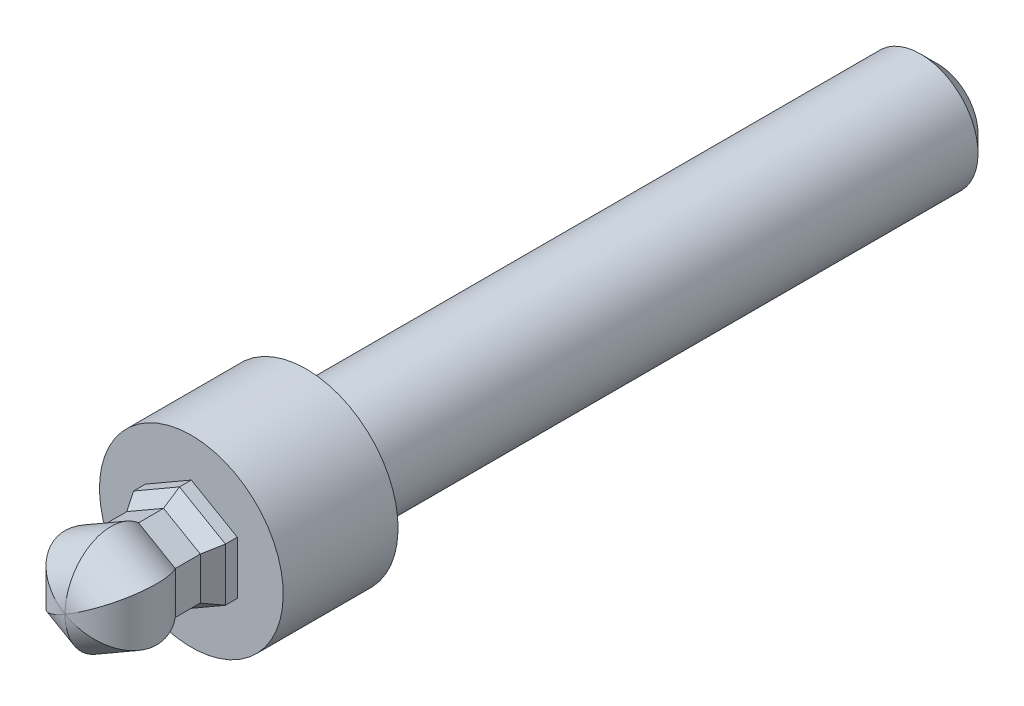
ISO-10303-21;
HEADER;
FILE_DESCRIPTION(('STEP AP214'),'2;1');
FILE_NAME('part.step','',(''),(''),'','','');
FILE_SCHEMA(('AUTOMOTIVE_DESIGN { 1 0 10303 214 1 1 1 1 }'));
ENDSEC;
DATA;
#1=APPLICATION_CONTEXT('core data for automotive mechanical design processes');
#2=APPLICATION_PROTOCOL_DEFINITION('international standard','automotive_design',2000,#1);
#3=PRODUCT_CONTEXT('',#1,'mechanical');
#4=PRODUCT('Part','Part','',(#3));
#5=PRODUCT_RELATED_PRODUCT_CATEGORY('part','',(#4));
#6=PRODUCT_DEFINITION_FORMATION('','',#4);
#7=PRODUCT_DEFINITION_CONTEXT('part definition',#1,'design');
#8=PRODUCT_DEFINITION('design','',#6,#7);
#9=PRODUCT_DEFINITION_SHAPE('','',#8);
#10=(LENGTH_UNIT() NAMED_UNIT(*) SI_UNIT(.MILLI.,.METRE.));
#11=(NAMED_UNIT(*) PLANE_ANGLE_UNIT() SI_UNIT($,.RADIAN.));
#12=(NAMED_UNIT(*) SI_UNIT($,.STERADIAN.) SOLID_ANGLE_UNIT());
#13=UNCERTAINTY_MEASURE_WITH_UNIT(LENGTH_MEASURE(1.E-05),#10,'distance_accuracy_value','');
#14=(GEOMETRIC_REPRESENTATION_CONTEXT(3) GLOBAL_UNCERTAINTY_ASSIGNED_CONTEXT((#13)) GLOBAL_UNIT_ASSIGNED_CONTEXT((#10,
#11,#12)) REPRESENTATION_CONTEXT('',''));
#15=CARTESIAN_POINT('',(0.,0.,0.));
#16=DIRECTION('',(0.,0.,1.));
#17=DIRECTION('',(1.,0.,0.));
#18=AXIS2_PLACEMENT_3D('',#15,#16,#17);
#19=CARTESIAN_POINT('',(0.,0.,-11.));
#20=DIRECTION('',(0.,0.,-1.));
#21=DIRECTION('',(-0.866025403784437,0.5,0.));
#22=AXIS2_PLACEMENT_3D('',#19,#20,#21);
#23=PLANE('',#22);
#24=CARTESIAN_POINT('',(0.,0.,-11.));
#25=DIRECTION('',(0.,0.,1.));
#26=DIRECTION('',(0.866025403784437,-0.5,0.));
#27=AXIS2_PLACEMENT_3D('',#24,#25,#26);
#28=CIRCLE('',#27,8.);
#29=CARTESIAN_POINT('',(6.92820323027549,-4.,-11.));
#30=VERTEX_POINT('',#29);
#31=EDGE_CURVE('E210',#30,#30,#28,.T.);
#32=ORIENTED_EDGE('',*,*,#31,.T.);
#33=EDGE_LOOP('',(#32));
#34=FACE_BOUND('',#33,.T.);
#35=DIRECTION('',(0.,-1.,0.));
#36=VECTOR('',#35,1.);
#37=CARTESIAN_POINT('',(-4.,0.,-11.));
#38=LINE('',#37,#36);
#39=CARTESIAN_POINT('',(-4.,2.30940107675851,-11.));
#40=VERTEX_POINT('',#39);
#41=CARTESIAN_POINT('',(-4.,-2.30940107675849,-11.));
#42=VERTEX_POINT('',#41);
#43=EDGE_CURVE('E29',#40,#42,#38,.T.);
#44=ORIENTED_EDGE('',*,*,#43,.F.);
#45=DIRECTION('',(-0.866025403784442,-0.5,0.));
#46=VECTOR('',#45,1.);
#47=CARTESIAN_POINT('',(-2.,3.46410161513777,-11.));
#48=LINE('',#47,#46);
#49=CARTESIAN_POINT('',(0.,4.61880215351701,-11.));
#50=VERTEX_POINT('',#49);
#51=EDGE_CURVE('E223',#50,#40,#48,.T.);
#52=ORIENTED_EDGE('',*,*,#51,.F.);
#53=DIRECTION('',(-0.866025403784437,0.5,0.));
#54=VECTOR('',#53,1.);
#55=CARTESIAN_POINT('',(2.,3.46410161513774,-11.));
#56=LINE('',#55,#54);
#57=CARTESIAN_POINT('',(4.,2.30940107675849,-11.));
#58=VERTEX_POINT('',#57);
#59=EDGE_CURVE('E37',#58,#50,#56,.T.);
#60=ORIENTED_EDGE('',*,*,#59,.F.);
#61=DIRECTION('',(0.,1.,0.));
#62=VECTOR('',#61,1.);
#63=CARTESIAN_POINT('',(4.,0.,-11.));
#64=LINE('',#63,#62);
#65=CARTESIAN_POINT('',(4.,-2.30940107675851,-11.));
#66=VERTEX_POINT('',#65);
#67=EDGE_CURVE('E213',#66,#58,#64,.T.);
#68=ORIENTED_EDGE('',*,*,#67,.F.);
#69=DIRECTION('',(0.866025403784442,0.5,0.));
#70=VECTOR('',#69,1.);
#71=CARTESIAN_POINT('',(2.,-3.46410161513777,-11.));
#72=LINE('',#71,#70);
#73=CARTESIAN_POINT('',(0.,-4.61880215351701,-11.));
#74=VERTEX_POINT('',#73);
#75=EDGE_CURVE('E216',#74,#66,#72,.T.);
#76=ORIENTED_EDGE('',*,*,#75,.F.);
#77=DIRECTION('',(0.866025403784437,-0.5,0.));
#78=VECTOR('',#77,1.);
#79=CARTESIAN_POINT('',(-2.,-3.46410161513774,-11.));
#80=LINE('',#79,#78);
#81=EDGE_CURVE('E219',#42,#74,#80,.T.);
#82=ORIENTED_EDGE('',*,*,#81,.F.);
#83=EDGE_LOOP('',(#44,#52,#60,#68,#76,#82));
#84=FACE_BOUND('',#83,.T.);
#85=ADVANCED_FACE('F14',(#34,#84),#23,.F.);
#86=CARTESIAN_POINT('',(0.,0.,-11.));
#87=DIRECTION('',(0.,0.,1.));
#88=DIRECTION('',(0.866025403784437,-0.5,0.));
#89=AXIS2_PLACEMENT_3D('',#86,#87,#88);
#90=CYLINDRICAL_SURFACE('',#89,8.);
#91=ORIENTED_EDGE('',*,*,#31,.F.);
#92=EDGE_LOOP('',(#91));
#93=FACE_BOUND('',#92,.T.);
#94=CARTESIAN_POINT('',(0.,0.,-21.));
#95=DIRECTION('',(0.,0.,1.));
#96=DIRECTION('',(0.866025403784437,-0.5,0.));
#97=AXIS2_PLACEMENT_3D('',#94,#95,#96);
#98=CIRCLE('',#97,8.);
#99=CARTESIAN_POINT('',(6.92820323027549,-4.,-21.));
#100=VERTEX_POINT('',#99);
#101=EDGE_CURVE('E207',#100,#100,#98,.T.);
#102=ORIENTED_EDGE('',*,*,#101,.T.);
#103=EDGE_LOOP('',(#102));
#104=FACE_BOUND('',#103,.T.);
#105=ADVANCED_FACE('F264',(#93,#104),#90,.T.);
#106=CARTESIAN_POINT('',(-4.,-6.92820323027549,-21.));
#107=DIRECTION('',(0.,0.,1.));
#108=DIRECTION('',(0.866025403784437,-0.5,0.));
#109=AXIS2_PLACEMENT_3D('',#106,#107,#108);
#110=PLANE('',#109);
#111=ORIENTED_EDGE('',*,*,#101,.F.);
#112=EDGE_LOOP('',(#111));
#113=FACE_BOUND('',#112,.T.);
#114=CARTESIAN_POINT('',(0.,0.,-21.));
#115=DIRECTION('',(0.,0.,1.));
#116=DIRECTION('',(0.866025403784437,-0.5,0.));
#117=AXIS2_PLACEMENT_3D('',#114,#115,#116);
#118=CIRCLE('',#117,5.);
#119=CARTESIAN_POINT('',(4.33012701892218,-2.5,-21.));
#120=VERTEX_POINT('',#119);
#121=EDGE_CURVE('E204',#120,#120,#118,.T.);
#122=ORIENTED_EDGE('',*,*,#121,.T.);
#123=EDGE_LOOP('',(#122));
#124=FACE_BOUND('',#123,.T.);
#125=ADVANCED_FACE('F261',(#113,#124),#110,.F.);
#126=CARTESIAN_POINT('',(0.,0.,-11.));
#127=DIRECTION('',(0.,0.,1.));
#128=DIRECTION('',(0.866025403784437,-0.5,0.));
#129=AXIS2_PLACEMENT_3D('',#126,#127,#128);
#130=CYLINDRICAL_SURFACE('',#129,5.);
#131=CARTESIAN_POINT('',(0.,0.,-74.5));
#132=DIRECTION('',(0.,0.,1.));
#133=DIRECTION('',(0.866025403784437,-0.5,0.));
#134=AXIS2_PLACEMENT_3D('',#131,#132,#133);
#135=CIRCLE('',#134,5.);
#136=CARTESIAN_POINT('',(4.33012701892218,-2.5,-74.5));
#137=VERTEX_POINT('',#136);
#138=EDGE_CURVE('E22',#137,#137,#135,.T.);
#139=ORIENTED_EDGE('',*,*,#138,.T.);
#140=EDGE_LOOP('',(#139));
#141=FACE_BOUND('',#140,.T.);
#142=ORIENTED_EDGE('',*,*,#121,.F.);
#143=EDGE_LOOP('',(#142));
#144=FACE_BOUND('',#143,.T.);
#145=ADVANCED_FACE('F228',(#141,#144),#130,.T.);
#146=CARTESIAN_POINT('',(-2.5,-4.33012701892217,-76.));
#147=DIRECTION('',(0.,0.,1.));
#148=DIRECTION('',(0.866025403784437,-0.5,0.));
#149=AXIS2_PLACEMENT_3D('',#146,#147,#148);
#150=PLANE('',#149);
#151=CARTESIAN_POINT('',(0.,0.,-76.));
#152=DIRECTION('',(0.,0.,1.));
#153=DIRECTION('',(0.866025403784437,-0.5,0.));
#154=AXIS2_PLACEMENT_3D('',#151,#152,#153);
#155=CIRCLE('',#154,3.5);
#156=CARTESIAN_POINT('',(3.03108891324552,-1.75,-76.));
#157=VERTEX_POINT('',#156);
#158=EDGE_CURVE('E9',#157,#157,#155,.F.);
#159=ORIENTED_EDGE('',*,*,#158,.T.);
#160=EDGE_LOOP('',(#159));
#161=FACE_BOUND('',#160,.T.);
#162=ADVANCED_FACE('F234',(#161),#150,.F.);
#163=CARTESIAN_POINT('',(21.6506350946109,-12.5,-4.));
#164=DIRECTION('',(-0.866025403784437,0.5,0.));
#165=DIRECTION('',(0.,0.,1.));
#166=AXIS2_PLACEMENT_3D('',#163,#164,#165);
#167=CYLINDRICAL_SURFACE('',#166,4.);
#168=DIRECTION('',(-0.866025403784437,0.5,0.));
#169=VECTOR('',#168,1.);
#170=CARTESIAN_POINT('',(23.2506350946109,-9.72871870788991,-6.4));
#171=LINE('',#170,#169);
#172=CARTESIAN_POINT('',(3.2,1.8475208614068,-6.4));
#173=VERTEX_POINT('',#172);
#174=CARTESIAN_POINT('',(0.,3.69504172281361,-6.4));
#175=VERTEX_POINT('',#174);
#176=EDGE_CURVE('E170',#173,#175,#171,.T.);
#177=ORIENTED_EDGE('',*,*,#176,.T.);
#178=CARTESIAN_POINT('',(0.,0.,-4.));
#179=DIRECTION('',(-1.,0.,0.));
#180=DIRECTION('',(0.,1.,0.));
#181=AXIS2_PLACEMENT_3D('',#178,#179,#180);
#182=ELLIPSE('',#181,4.61880215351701,4.);
#183=CARTESIAN_POINT('',(0.,0.,0.));
#184=VERTEX_POINT('',#183);
#185=EDGE_CURVE('E191',#175,#184,#182,.F.);
#186=ORIENTED_EDGE('',*,*,#185,.T.);
#187=CARTESIAN_POINT('',(0.,0.,-4.));
#188=DIRECTION('',(-0.5,0.866025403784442,0.));
#189=DIRECTION('',(-0.866025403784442,-0.5,0.));
#190=AXIS2_PLACEMENT_3D('',#187,#188,#189);
#191=ELLIPSE('',#190,4.618802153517,4.);
#192=EDGE_CURVE('E134',#184,#173,#191,.T.);
#193=ORIENTED_EDGE('',*,*,#192,.T.);
#194=EDGE_LOOP('',(#177,#186,#193));
#195=FACE_BOUND('',#194,.T.);
#196=ADVANCED_FACE('F243',(#195),#167,.T.);
#197=DIRECTION('',(-0.866025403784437,0.5,0.));
#198=VECTOR('',#197,1.);
#199=CARTESIAN_POINT('',(20.0506350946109,-15.2712812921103,-6.4));
#200=LINE('',#199,#198);
#201=CARTESIAN_POINT('',(0.,-3.69504172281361,-6.4));
#202=VERTEX_POINT('',#201);
#203=CARTESIAN_POINT('',(-3.2,-1.84752086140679,-6.4));
#204=VERTEX_POINT('',#203);
#205=EDGE_CURVE('E169',#202,#204,#200,.T.);
#206=ORIENTED_EDGE('',*,*,#205,.F.);
#207=CARTESIAN_POINT('',(0.,0.,-4.));
#208=DIRECTION('',(-1.,0.,0.));
#209=DIRECTION('',(0.,1.,0.));
#210=AXIS2_PLACEMENT_3D('',#207,#208,#209);
#211=ELLIPSE('',#210,4.61880215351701,4.);
#212=EDGE_CURVE('E127',#202,#184,#211,.T.);
#213=ORIENTED_EDGE('',*,*,#212,.T.);
#214=CARTESIAN_POINT('',(0.,0.,-4.));
#215=DIRECTION('',(-0.5,0.866025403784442,0.));
#216=DIRECTION('',(-0.866025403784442,-0.5,0.));
#217=AXIS2_PLACEMENT_3D('',#214,#215,#216);
#218=ELLIPSE('',#217,4.618802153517,4.);
#219=EDGE_CURVE('E173',#184,#204,#218,.F.);
#220=ORIENTED_EDGE('',*,*,#219,.T.);
#221=EDGE_LOOP('',(#206,#213,#220));
#222=FACE_BOUND('',#221,.T.);
#223=ADVANCED_FACE('F247',(#222),#167,.T.);
#224=CARTESIAN_POINT('',(0.,25.,-4.));
#225=DIRECTION('',(0.,-1.,0.));
#226=DIRECTION('',(-1.,0.,0.));
#227=AXIS2_PLACEMENT_3D('',#224,#225,#226);
#228=CYLINDRICAL_SURFACE('',#227,4.);
#229=CARTESIAN_POINT('',(0.,0.,-4.));
#230=DIRECTION('',(-0.5,-0.866025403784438,0.));
#231=DIRECTION('',(-0.866025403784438,0.5,0.));
#232=AXIS2_PLACEMENT_3D('',#229,#230,#231);
#233=ELLIPSE('',#232,4.61880215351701,4.);
#234=CARTESIAN_POINT('',(-3.2,1.8475208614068,-6.4));
#235=VERTEX_POINT('',#234);
#236=EDGE_CURVE('E136',#235,#184,#233,.F.);
#237=ORIENTED_EDGE('',*,*,#236,.F.);
#238=DIRECTION('',(0.,-1.,0.));
#239=VECTOR('',#238,1.);
#240=CARTESIAN_POINT('',(-3.2,25.,-6.4));
#241=LINE('',#240,#239);
#242=EDGE_CURVE('E539',#235,#204,#241,.T.);
#243=ORIENTED_EDGE('',*,*,#242,.T.);
#244=ORIENTED_EDGE('',*,*,#219,.F.);
#245=EDGE_LOOP('',(#237,#243,#244));
#246=FACE_BOUND('',#245,.T.);
#247=ADVANCED_FACE('F253',(#246),#228,.T.);
#248=CARTESIAN_POINT('',(21.6506350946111,12.5,-4.));
#249=DIRECTION('',(-0.866025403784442,-0.5,0.));
#250=DIRECTION('',(-0.5,0.866025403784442,0.));
#251=AXIS2_PLACEMENT_3D('',#248,#249,#250);
#252=CYLINDRICAL_SURFACE('',#251,4.);
#253=DIRECTION('',(-0.866025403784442,-0.5,0.));
#254=VECTOR('',#253,1.);
#255=CARTESIAN_POINT('',(20.050635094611,15.2712812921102,-6.4));
#256=LINE('',#255,#254);
#257=EDGE_CURVE('E143',#175,#235,#256,.T.);
#258=ORIENTED_EDGE('',*,*,#257,.T.);
#259=ORIENTED_EDGE('',*,*,#236,.T.);
#260=ORIENTED_EDGE('',*,*,#185,.F.);
#261=EDGE_LOOP('',(#258,#259,#260));
#262=FACE_BOUND('',#261,.T.);
#263=ADVANCED_FACE('F317',(#262),#252,.T.);
#264=DIRECTION('',(-0.866025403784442,-0.5,0.));
#265=VECTOR('',#264,1.);
#266=CARTESIAN_POINT('',(23.250635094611,9.72871870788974,-6.4));
#267=LINE('',#266,#265);
#268=CARTESIAN_POINT('',(3.2,-1.8475208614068,-6.4));
#269=VERTEX_POINT('',#268);
#270=EDGE_CURVE('E123',#269,#202,#267,.T.);
#271=ORIENTED_EDGE('',*,*,#270,.F.);
#272=CARTESIAN_POINT('',(0.,0.,-4.));
#273=DIRECTION('',(-0.5,-0.866025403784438,0.));
#274=DIRECTION('',(-0.866025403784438,0.5,0.));
#275=AXIS2_PLACEMENT_3D('',#272,#273,#274);
#276=ELLIPSE('',#275,4.61880215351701,4.);
#277=EDGE_CURVE('E125',#269,#184,#276,.T.);
#278=ORIENTED_EDGE('',*,*,#277,.T.);
#279=ORIENTED_EDGE('',*,*,#212,.F.);
#280=EDGE_LOOP('',(#271,#278,#279));
#281=FACE_BOUND('',#280,.T.);
#282=ADVANCED_FACE('F124',(#281),#252,.T.);
#283=ORIENTED_EDGE('',*,*,#277,.F.);
#284=DIRECTION('',(0.,-1.,0.));
#285=VECTOR('',#284,1.);
#286=CARTESIAN_POINT('',(3.2,25.,-6.4));
#287=LINE('',#286,#285);
#288=EDGE_CURVE('E106',#173,#269,#287,.T.);
#289=ORIENTED_EDGE('',*,*,#288,.F.);
#290=ORIENTED_EDGE('',*,*,#192,.F.);
#291=EDGE_LOOP('',(#283,#289,#290));
#292=FACE_BOUND('',#291,.T.);
#293=ADVANCED_FACE('F133',(#292),#228,.T.);
#294=CARTESIAN_POINT('',(23.2506350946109,-9.72871870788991,-6.4));
#295=DIRECTION('',(-0.5,-0.866025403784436,0.));
#296=DIRECTION('',(0.,0.,1.));
#297=AXIS2_PLACEMENT_3D('',#294,#295,#296);
#298=PLANE('',#297);
#299=DIRECTION('',(-0.866025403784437,0.5,0.));
#300=VECTOR('',#299,1.);
#301=CARTESIAN_POINT('',(23.2506350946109,-9.72871870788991,-8.58));
#302=LINE('',#301,#300);
#303=CARTESIAN_POINT('',(3.2,1.84752086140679,-8.58));
#304=VERTEX_POINT('',#303);
#305=CARTESIAN_POINT('',(0.,3.69504172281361,-8.58));
#306=VERTEX_POINT('',#305);
#307=EDGE_CURVE('E174',#304,#306,#302,.T.);
#308=ORIENTED_EDGE('',*,*,#307,.T.);
#309=DIRECTION('',(0.,0.,1.));
#310=VECTOR('',#309,1.);
#311=CARTESIAN_POINT('',(0.,3.69504172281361,-6.4));
#312=LINE('',#311,#310);
#313=EDGE_CURVE('E154',#306,#175,#312,.T.);
#314=ORIENTED_EDGE('',*,*,#313,.T.);
#315=ORIENTED_EDGE('',*,*,#176,.F.);
#316=DIRECTION('',(0.,0.,-1.));
#317=VECTOR('',#316,1.);
#318=CARTESIAN_POINT('',(3.2,1.8475208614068,-6.4));
#319=LINE('',#318,#317);
#320=EDGE_CURVE('E114',#173,#304,#319,.T.);
#321=ORIENTED_EDGE('',*,*,#320,.T.);
#322=EDGE_LOOP('',(#308,#314,#315,#321));
#323=FACE_BOUND('',#322,.T.);
#324=ADVANCED_FACE('F343',(#323),#298,.F.);
#325=CARTESIAN_POINT('',(20.0506350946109,-15.2712812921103,-6.4));
#326=DIRECTION('',(0.5,0.866025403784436,0.));
#327=DIRECTION('',(0.,0.,-1.));
#328=AXIS2_PLACEMENT_3D('',#325,#326,#327);
#329=PLANE('',#328);
#330=DIRECTION('',(-0.866025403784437,0.5,0.));
#331=VECTOR('',#330,1.);
#332=CARTESIAN_POINT('',(20.0506350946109,-15.2712812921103,-8.58));
#333=LINE('',#332,#331);
#334=CARTESIAN_POINT('',(0.,-3.69504172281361,-8.58));
#335=VERTEX_POINT('',#334);
#336=CARTESIAN_POINT('',(-3.2,-1.8475208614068,-8.58));
#337=VERTEX_POINT('',#336);
#338=EDGE_CURVE('E183',#335,#337,#333,.T.);
#339=ORIENTED_EDGE('',*,*,#338,.F.);
#340=DIRECTION('',(0.,0.,1.));
#341=VECTOR('',#340,1.);
#342=CARTESIAN_POINT('',(0.,-3.69504172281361,-6.4));
#343=LINE('',#342,#341);
#344=EDGE_CURVE('E152',#335,#202,#343,.T.);
#345=ORIENTED_EDGE('',*,*,#344,.T.);
#346=ORIENTED_EDGE('',*,*,#205,.T.);
#347=DIRECTION('',(0.,0.,-1.));
#348=VECTOR('',#347,1.);
#349=CARTESIAN_POINT('',(-3.2,-1.8475208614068,-6.4));
#350=LINE('',#349,#348);
#351=EDGE_CURVE('E142',#204,#337,#350,.T.);
#352=ORIENTED_EDGE('',*,*,#351,.T.);
#353=EDGE_LOOP('',(#339,#345,#346,#352));
#354=FACE_BOUND('',#353,.T.);
#355=ADVANCED_FACE('F256',(#354),#329,.F.);
#356=CARTESIAN_POINT('',(-3.2,25.,-6.4));
#357=DIRECTION('',(1.,0.,0.));
#358=DIRECTION('',(0.,-1.,0.));
#359=AXIS2_PLACEMENT_3D('',#356,#357,#358);
#360=PLANE('',#359);
#361=ORIENTED_EDGE('',*,*,#242,.F.);
#362=DIRECTION('',(0.,0.,1.));
#363=VECTOR('',#362,1.);
#364=CARTESIAN_POINT('',(-3.2,1.8475208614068,-6.4));
#365=LINE('',#364,#363);
#366=CARTESIAN_POINT('',(-3.2,1.84752086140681,-8.58));
#367=VERTEX_POINT('',#366);
#368=EDGE_CURVE('E137',#367,#235,#365,.T.);
#369=ORIENTED_EDGE('',*,*,#368,.F.);
#370=DIRECTION('',(0.,-1.,0.));
#371=VECTOR('',#370,1.);
#372=CARTESIAN_POINT('',(-3.2,25.,-8.58));
#373=LINE('',#372,#371);
#374=EDGE_CURVE('E530',#367,#337,#373,.T.);
#375=ORIENTED_EDGE('',*,*,#374,.T.);
#376=ORIENTED_EDGE('',*,*,#351,.F.);
#377=EDGE_LOOP('',(#361,#369,#375,#376));
#378=FACE_BOUND('',#377,.T.);
#379=ADVANCED_FACE('F360',(#378),#360,.F.);
#380=CARTESIAN_POINT('',(20.050635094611,15.2712812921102,-6.4));
#381=DIRECTION('',(0.5,-0.866025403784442,0.));
#382=DIRECTION('',(-0.866025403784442,-0.5,0.));
#383=AXIS2_PLACEMENT_3D('',#380,#381,#382);
#384=PLANE('',#383);
#385=DIRECTION('',(-0.866025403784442,-0.5,0.));
#386=VECTOR('',#385,1.);
#387=CARTESIAN_POINT('',(20.050635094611,15.2712812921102,-8.58));
#388=LINE('',#387,#386);
#389=EDGE_CURVE('E147',#306,#367,#388,.T.);
#390=ORIENTED_EDGE('',*,*,#389,.T.);
#391=ORIENTED_EDGE('',*,*,#368,.T.);
#392=ORIENTED_EDGE('',*,*,#257,.F.);
#393=ORIENTED_EDGE('',*,*,#313,.F.);
#394=EDGE_LOOP('',(#390,#391,#392,#393));
#395=FACE_BOUND('',#394,.T.);
#396=ADVANCED_FACE('F369',(#395),#384,.F.);
#397=CARTESIAN_POINT('',(23.250635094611,9.72871870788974,-6.4));
#398=DIRECTION('',(-0.5,0.866025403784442,0.));
#399=DIRECTION('',(0.866025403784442,0.5,0.));
#400=AXIS2_PLACEMENT_3D('',#397,#398,#399);
#401=PLANE('',#400);
#402=DIRECTION('',(-0.866025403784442,-0.5,0.));
#403=VECTOR('',#402,1.);
#404=CARTESIAN_POINT('',(23.250635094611,9.72871870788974,-8.58));
#405=LINE('',#404,#403);
#406=CARTESIAN_POINT('',(3.2,-1.84752086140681,-8.58));
#407=VERTEX_POINT('',#406);
#408=EDGE_CURVE('E130',#407,#335,#405,.T.);
#409=ORIENTED_EDGE('',*,*,#408,.F.);
#410=DIRECTION('',(0.,0.,1.));
#411=VECTOR('',#410,1.);
#412=CARTESIAN_POINT('',(3.2,-1.84752086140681,-6.4));
#413=LINE('',#412,#411);
#414=EDGE_CURVE('E111',#407,#269,#413,.T.);
#415=ORIENTED_EDGE('',*,*,#414,.T.);
#416=ORIENTED_EDGE('',*,*,#270,.T.);
#417=ORIENTED_EDGE('',*,*,#344,.F.);
#418=EDGE_LOOP('',(#409,#415,#416,#417));
#419=FACE_BOUND('',#418,.T.);
#420=ADVANCED_FACE('F139',(#419),#401,.F.);
#421=CARTESIAN_POINT('',(3.2,25.,-6.4));
#422=DIRECTION('',(-1.,0.,0.));
#423=DIRECTION('',(0.,1.,0.));
#424=AXIS2_PLACEMENT_3D('',#421,#422,#423);
#425=PLANE('',#424);
#426=ORIENTED_EDGE('',*,*,#288,.T.);
#427=ORIENTED_EDGE('',*,*,#414,.F.);
#428=DIRECTION('',(0.,-1.,0.));
#429=VECTOR('',#428,1.);
#430=CARTESIAN_POINT('',(3.2,25.,-8.58));
#431=LINE('',#430,#429);
#432=EDGE_CURVE('E119',#304,#407,#431,.T.);
#433=ORIENTED_EDGE('',*,*,#432,.F.);
#434=ORIENTED_EDGE('',*,*,#320,.F.);
#435=EDGE_LOOP('',(#426,#427,#433,#434));
#436=FACE_BOUND('',#435,.T.);
#437=ADVANCED_FACE('F108',(#436),#425,.F.);
#438=CARTESIAN_POINT('',(23.2506350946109,-9.72871870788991,-8.58));
#439=DIRECTION('',(-0.433012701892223,-0.75,-0.5));
#440=DIRECTION('',(-0.25,-0.433012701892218,0.866025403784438));
#441=AXIS2_PLACEMENT_3D('',#438,#439,#440);
#442=PLANE('',#441);
#443=DIRECTION('',(-0.866025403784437,0.5,0.));
#444=VECTOR('',#443,1.);
#445=CARTESIAN_POINT('',(23.650635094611,-9.03589838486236,-9.9656406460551));
#446=LINE('',#445,#444);
#447=CARTESIAN_POINT('',(4.,2.30940107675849,-9.9656406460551));
#448=VERTEX_POINT('',#447);
#449=CARTESIAN_POINT('',(0.,4.61880215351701,-9.9656406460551));
#450=VERTEX_POINT('',#449);
#451=EDGE_CURVE('E177',#448,#450,#446,.T.);
#452=ORIENTED_EDGE('',*,*,#451,.T.);
#453=DIRECTION('',(0.,-0.55470019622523,0.832050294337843));
#454=VECTOR('',#453,1.);
#455=CARTESIAN_POINT('',(0.,-0.435346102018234,-2.38441826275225));
#456=LINE('',#455,#454);
#457=EDGE_CURVE('E166',#450,#306,#456,.T.);
#458=ORIENTED_EDGE('',*,*,#457,.T.);
#459=ORIENTED_EDGE('',*,*,#307,.F.);
#460=DIRECTION('',(0.480384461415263,0.277350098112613,-0.832050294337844));
#461=VECTOR('',#460,1.);
#462=CARTESIAN_POINT('',(6.28471309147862,3.62848079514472,-13.9228798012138));
#463=LINE('',#462,#461);
#464=EDGE_CURVE('E163',#304,#448,#463,.T.);
#465=ORIENTED_EDGE('',*,*,#464,.T.);
#466=EDGE_LOOP('',(#452,#458,#459,#465));
#467=FACE_BOUND('',#466,.T.);
#468=ADVANCED_FACE('F396',(#467),#442,.F.);
#469=CARTESIAN_POINT('',(20.0506350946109,-15.2712812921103,-8.58));
#470=DIRECTION('',(0.433012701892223,0.75,-0.5));
#471=DIRECTION('',(-0.25,-0.433012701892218,-0.866025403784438));
#472=AXIS2_PLACEMENT_3D('',#469,#470,#471);
#473=PLANE('',#472);
#474=DIRECTION('',(-0.866025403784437,0.5,0.));
#475=VECTOR('',#474,1.);
#476=CARTESIAN_POINT('',(19.6506350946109,-15.9641016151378,-9.9656406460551));
#477=LINE('',#476,#475);
#478=CARTESIAN_POINT('',(0.,-4.61880215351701,-9.9656406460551));
#479=VERTEX_POINT('',#478);
#480=CARTESIAN_POINT('',(-4.,-2.30940107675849,-9.9656406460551));
#481=VERTEX_POINT('',#480);
#482=EDGE_CURVE('E180',#479,#481,#477,.T.);
#483=ORIENTED_EDGE('',*,*,#482,.F.);
#484=DIRECTION('',(0.,0.55470019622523,0.832050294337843));
#485=VECTOR('',#484,1.);
#486=CARTESIAN_POINT('',(0.,-7.25696159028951,-13.9228798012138));
#487=LINE('',#486,#485);
#488=EDGE_CURVE('E160',#479,#335,#487,.T.);
#489=ORIENTED_EDGE('',*,*,#488,.T.);
#490=ORIENTED_EDGE('',*,*,#338,.T.);
#491=DIRECTION('',(-0.480384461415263,-0.277350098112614,-0.832050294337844));
#492=VECTOR('',#491,1.);
#493=CARTESIAN_POINT('',(0.377020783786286,0.217673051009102,-2.38441826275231));
#494=LINE('',#493,#492);
#495=EDGE_CURVE('E157',#337,#481,#494,.T.);
#496=ORIENTED_EDGE('',*,*,#495,.T.);
#497=EDGE_LOOP('',(#483,#489,#490,#496));
#498=FACE_BOUND('',#497,.T.);
#499=ADVANCED_FACE('F405',(#498),#473,.F.);
#500=CARTESIAN_POINT('',(-3.2,25.,-8.58));
#501=DIRECTION('',(0.86602540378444,0.,-0.5));
#502=DIRECTION('',(-0.480384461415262,0.277350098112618,-0.832050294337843));
#503=AXIS2_PLACEMENT_3D('',#500,#501,#502);
#504=PLANE('',#503);
#505=ORIENTED_EDGE('',*,*,#374,.F.);
#506=DIRECTION('',(0.480384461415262,-0.277350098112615,0.832050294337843));
#507=VECTOR('',#506,1.);
#508=CARTESIAN_POINT('',(0.377020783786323,-0.217673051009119,-2.38441826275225));
#509=LINE('',#508,#507);
#510=CARTESIAN_POINT('',(-4.,2.30940107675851,-9.9656406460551));
#511=VERTEX_POINT('',#510);
#512=EDGE_CURVE('E529',#511,#367,#509,.T.);
#513=ORIENTED_EDGE('',*,*,#512,.F.);
#514=DIRECTION('',(0.,-1.,0.));
#515=VECTOR('',#514,1.);
#516=CARTESIAN_POINT('',(-4.,25.,-9.9656406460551));
#517=LINE('',#516,#515);
#518=EDGE_CURVE('E524',#511,#481,#517,.T.);
#519=ORIENTED_EDGE('',*,*,#518,.T.);
#520=ORIENTED_EDGE('',*,*,#495,.F.);
#521=EDGE_LOOP('',(#505,#513,#519,#520));
#522=FACE_BOUND('',#521,.T.);
#523=ADVANCED_FACE('F415',(#522),#504,.F.);
#524=CARTESIAN_POINT('',(20.050635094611,15.2712812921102,-8.58));
#525=DIRECTION('',(0.433012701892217,-0.75,-0.5));
#526=DIRECTION('',(-0.48038446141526,0.277350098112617,-0.832050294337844));
#527=AXIS2_PLACEMENT_3D('',#524,#525,#526);
#528=PLANE('',#527);
#529=DIRECTION('',(-0.866025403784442,-0.5,0.));
#530=VECTOR('',#529,1.);
#531=CARTESIAN_POINT('',(19.650635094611,15.9641016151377,-9.9656406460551));
#532=LINE('',#531,#530);
#533=EDGE_CURVE('E551',#450,#511,#532,.T.);
#534=ORIENTED_EDGE('',*,*,#533,.T.);
#535=ORIENTED_EDGE('',*,*,#512,.T.);
#536=ORIENTED_EDGE('',*,*,#389,.F.);
#537=ORIENTED_EDGE('',*,*,#457,.F.);
#538=EDGE_LOOP('',(#534,#535,#536,#537));
#539=FACE_BOUND('',#538,.T.);
#540=ADVANCED_FACE('F424',(#539),#528,.F.);
#541=CARTESIAN_POINT('',(23.250635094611,9.72871870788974,-8.58));
#542=DIRECTION('',(-0.433012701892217,0.75,-0.5));
#543=DIRECTION('',(-0.480384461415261,0.277350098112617,0.832050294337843));
#544=AXIS2_PLACEMENT_3D('',#541,#542,#543);
#545=PLANE('',#544);
#546=DIRECTION('',(-0.866025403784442,-0.5,0.));
#547=VECTOR('',#546,1.);
#548=CARTESIAN_POINT('',(23.650635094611,9.03589838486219,-9.9656406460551));
#549=LINE('',#548,#547);
#550=CARTESIAN_POINT('',(4.,-2.30940107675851,-9.9656406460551));
#551=VERTEX_POINT('',#550);
#552=EDGE_CURVE('E554',#551,#479,#549,.T.);
#553=ORIENTED_EDGE('',*,*,#552,.F.);
#554=DIRECTION('',(-0.480384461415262,0.277350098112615,0.832050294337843));
#555=VECTOR('',#554,1.);
#556=CARTESIAN_POINT('',(6.28471309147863,-3.62848079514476,-13.9228798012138));
#557=LINE('',#556,#555);
#558=EDGE_CURVE('E558',#551,#407,#557,.T.);
#559=ORIENTED_EDGE('',*,*,#558,.T.);
#560=ORIENTED_EDGE('',*,*,#408,.T.);
#561=ORIENTED_EDGE('',*,*,#488,.F.);
#562=EDGE_LOOP('',(#553,#559,#560,#561));
#563=FACE_BOUND('',#562,.T.);
#564=ADVANCED_FACE('F434',(#563),#545,.F.);
#565=CARTESIAN_POINT('',(3.2,25.,-8.58));
#566=DIRECTION('',(-0.86602540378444,0.,-0.5));
#567=DIRECTION('',(-0.480384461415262,0.277350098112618,0.832050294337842));
#568=AXIS2_PLACEMENT_3D('',#565,#566,#567);
#569=PLANE('',#568);
#570=ORIENTED_EDGE('',*,*,#432,.T.);
#571=ORIENTED_EDGE('',*,*,#558,.F.);
#572=DIRECTION('',(0.,-1.,0.));
#573=VECTOR('',#572,1.);
#574=CARTESIAN_POINT('',(4.,25.,-9.9656406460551));
#575=LINE('',#574,#573);
#576=EDGE_CURVE('E531',#448,#551,#575,.T.);
#577=ORIENTED_EDGE('',*,*,#576,.F.);
#578=ORIENTED_EDGE('',*,*,#464,.F.);
#579=EDGE_LOOP('',(#570,#571,#577,#578));
#580=FACE_BOUND('',#579,.T.);
#581=ADVANCED_FACE('F444',(#580),#569,.F.);
#582=CARTESIAN_POINT('',(4.,25.,-9.9656406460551));
#583=DIRECTION('',(-1.,0.,0.));
#584=DIRECTION('',(0.,1.,0.));
#585=AXIS2_PLACEMENT_3D('',#582,#583,#584);
#586=PLANE('',#585);
#587=DIRECTION('',(0.,0.,1.));
#588=VECTOR('',#587,1.);
#589=CARTESIAN_POINT('',(4.,-2.30940107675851,-9.9656406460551));
#590=LINE('',#589,#588);
#591=EDGE_CURVE('E544',#66,#551,#590,.T.);
#592=ORIENTED_EDGE('',*,*,#591,.F.);
#593=ORIENTED_EDGE('',*,*,#67,.T.);
#594=DIRECTION('',(0.,0.,-1.));
#595=VECTOR('',#594,1.);
#596=CARTESIAN_POINT('',(4.,2.30940107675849,-9.96564064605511));
#597=LINE('',#596,#595);
#598=EDGE_CURVE('E200',#448,#58,#597,.T.);
#599=ORIENTED_EDGE('',*,*,#598,.F.);
#600=ORIENTED_EDGE('',*,*,#576,.T.);
#601=EDGE_LOOP('',(#592,#593,#599,#600));
#602=FACE_BOUND('',#601,.T.);
#603=ADVANCED_FACE('F454',(#602),#586,.F.);
#604=CARTESIAN_POINT('',(23.650635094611,9.03589838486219,-9.9656406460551));
#605=DIRECTION('',(-0.5,0.866025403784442,0.));
#606=DIRECTION('',(0.866025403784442,0.5,0.));
#607=AXIS2_PLACEMENT_3D('',#604,#605,#606);
#608=PLANE('',#607);
#609=DIRECTION('',(0.,0.,1.));
#610=VECTOR('',#609,1.);
#611=CARTESIAN_POINT('',(0.,-4.61880215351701,-9.9656406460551));
#612=LINE('',#611,#610);
#613=EDGE_CURVE('E198',#74,#479,#612,.T.);
#614=ORIENTED_EDGE('',*,*,#613,.F.);
#615=ORIENTED_EDGE('',*,*,#75,.T.);
#616=ORIENTED_EDGE('',*,*,#591,.T.);
#617=ORIENTED_EDGE('',*,*,#552,.T.);
#618=EDGE_LOOP('',(#614,#615,#616,#617));
#619=FACE_BOUND('',#618,.T.);
#620=ADVANCED_FACE('F464',(#619),#608,.F.);
#621=CARTESIAN_POINT('',(19.650635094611,15.9641016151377,-9.9656406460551));
#622=DIRECTION('',(0.5,-0.866025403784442,0.));
#623=DIRECTION('',(-0.866025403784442,-0.5,0.));
#624=AXIS2_PLACEMENT_3D('',#621,#622,#623);
#625=PLANE('',#624);
#626=DIRECTION('',(0.,0.,1.));
#627=VECTOR('',#626,1.);
#628=CARTESIAN_POINT('',(0.,4.61880215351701,-9.9656406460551));
#629=LINE('',#628,#627);
#630=EDGE_CURVE('E202',#50,#450,#629,.T.);
#631=ORIENTED_EDGE('',*,*,#630,.F.);
#632=ORIENTED_EDGE('',*,*,#51,.T.);
#633=DIRECTION('',(0.,0.,1.));
#634=VECTOR('',#633,1.);
#635=CARTESIAN_POINT('',(-4.,2.30940107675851,-9.9656406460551));
#636=LINE('',#635,#634);
#637=EDGE_CURVE('E131',#40,#511,#636,.T.);
#638=ORIENTED_EDGE('',*,*,#637,.T.);
#639=ORIENTED_EDGE('',*,*,#533,.F.);
#640=EDGE_LOOP('',(#631,#632,#638,#639));
#641=FACE_BOUND('',#640,.T.);
#642=ADVANCED_FACE('F474',(#641),#625,.F.);
#643=CARTESIAN_POINT('',(-4.,25.,-9.9656406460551));
#644=DIRECTION('',(1.,0.,0.));
#645=DIRECTION('',(0.,-1.,0.));
#646=AXIS2_PLACEMENT_3D('',#643,#644,#645);
#647=PLANE('',#646);
#648=ORIENTED_EDGE('',*,*,#637,.F.);
#649=ORIENTED_EDGE('',*,*,#43,.T.);
#650=DIRECTION('',(0.,0.,-1.));
#651=VECTOR('',#650,1.);
#652=CARTESIAN_POINT('',(-4.,-2.30940107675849,-9.96564064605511));
#653=LINE('',#652,#651);
#654=EDGE_CURVE('E195',#481,#42,#653,.T.);
#655=ORIENTED_EDGE('',*,*,#654,.F.);
#656=ORIENTED_EDGE('',*,*,#518,.F.);
#657=EDGE_LOOP('',(#648,#649,#655,#656));
#658=FACE_BOUND('',#657,.T.);
#659=ADVANCED_FACE('F484',(#658),#647,.F.);
#660=CARTESIAN_POINT('',(19.6506350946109,-15.9641016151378,-9.9656406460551));
#661=DIRECTION('',(0.5,0.866025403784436,0.));
#662=DIRECTION('',(0.,0.,-1.));
#663=AXIS2_PLACEMENT_3D('',#660,#661,#662);
#664=PLANE('',#663);
#665=ORIENTED_EDGE('',*,*,#654,.T.);
#666=ORIENTED_EDGE('',*,*,#81,.T.);
#667=ORIENTED_EDGE('',*,*,#613,.T.);
#668=ORIENTED_EDGE('',*,*,#482,.T.);
#669=EDGE_LOOP('',(#665,#666,#667,#668));
#670=FACE_BOUND('',#669,.T.);
#671=ADVANCED_FACE('F239',(#670),#664,.F.);
#672=CARTESIAN_POINT('',(23.650635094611,-9.03589838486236,-9.9656406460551));
#673=DIRECTION('',(-0.5,-0.866025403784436,0.));
#674=DIRECTION('',(0.,0.,1.));
#675=AXIS2_PLACEMENT_3D('',#672,#673,#674);
#676=PLANE('',#675);
#677=ORIENTED_EDGE('',*,*,#598,.T.);
#678=ORIENTED_EDGE('',*,*,#59,.T.);
#679=ORIENTED_EDGE('',*,*,#630,.T.);
#680=ORIENTED_EDGE('',*,*,#451,.F.);
#681=EDGE_LOOP('',(#677,#678,#679,#680));
#682=FACE_BOUND('',#681,.T.);
#683=ADVANCED_FACE('F232',(#682),#676,.F.);
#684=CARTESIAN_POINT('',(0.,0.,-74.5));
#685=DIRECTION('',(0.,0.,1.));
#686=DIRECTION('',(0.866025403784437,-0.5,0.));
#687=AXIS2_PLACEMENT_3D('',#684,#685,#686);
#688=CONICAL_SURFACE('',#687,5.,0.785398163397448);
#689=ORIENTED_EDGE('',*,*,#158,.F.);
#690=EDGE_LOOP('',(#689));
#691=FACE_BOUND('',#690,.T.);
#692=ORIENTED_EDGE('',*,*,#138,.F.);
#693=EDGE_LOOP('',(#692));
#694=FACE_BOUND('',#693,.T.);
#695=ADVANCED_FACE('F16',(#691,#694),#688,.T.);
#696=CLOSED_SHELL('',(#85,#105,#125,#145,#162,#196,#223,#247,#263,#282,#293,#324,#355,#379,#396,
#420,#437,#468,#499,#523,#540,#564,#581,#603,#620,#642,#659,#671,#683,#695));
#697=MANIFOLD_SOLID_BREP('B1',#696);
#698=ADVANCED_BREP_SHAPE_REPRESENTATION('',(#18,#697),#14);
#699=SHAPE_DEFINITION_REPRESENTATION(#9,#698);
ENDSEC;
END-ISO-10303-21;
